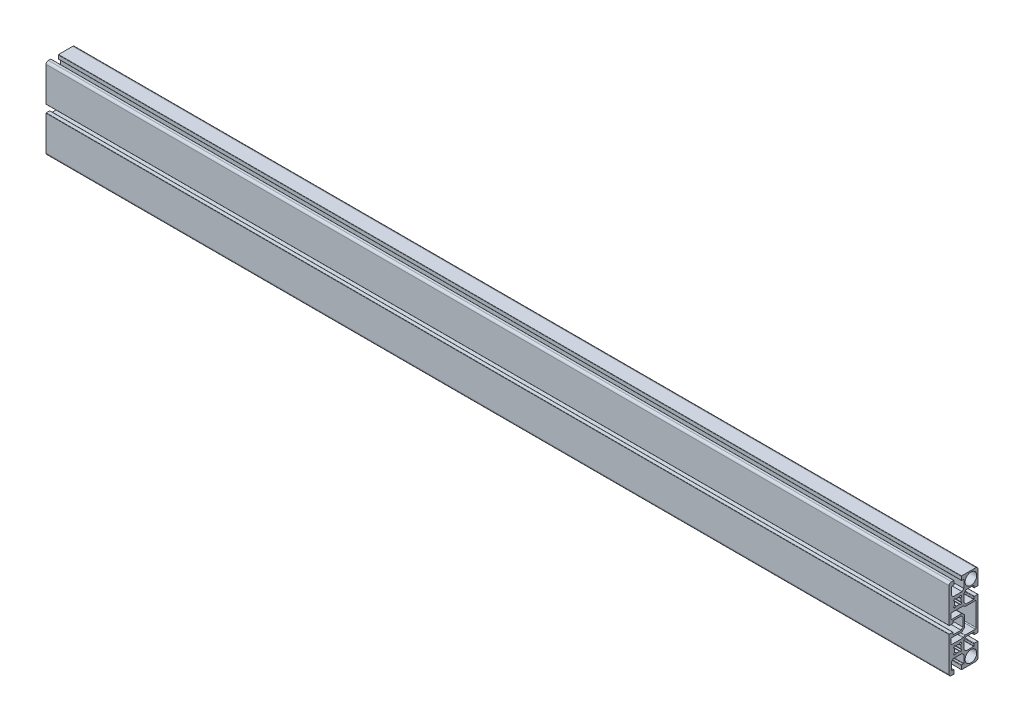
from build123d import *

# Parameters (mm, degrees)
MODEL23_R                       = 6.450000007
MODEL23_R_2                     = 6.449998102
F_45_SARJA_1_0033_90X32_1_DEPTH = 1000


with BuildPart() as part:
    # Model23 → 45-sarja 1.0033 90X32_1 (new body)
    with BuildSketch(Plane.YZ):
        with BuildLine():
            Line((-40.99999978, -4.099999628), (-44.699999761, -4.099999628))
            ThreePointArc((-44.699999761, -4.099999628), (-44.912131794, -4.187867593), (-44.999999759, -4.399999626))
            Line((-44.999999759, -4.399999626), (-44.999999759, -19.999999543))
            ThreePointArc((-44.999999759, -19.999999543), (-44.267766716, -21.767766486), (-42.499999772, -22.499999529))
            Line((-42.499999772, -22.499999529), (-26.899999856, -22.499999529))
            ThreePointArc((-26.899999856, -22.499999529), (-26.687867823, -22.412131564), (-26.599999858, -22.199999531))
            Line((-26.599999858, -22.199999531), (-26.599999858, -18.499999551))
            ThreePointArc((-26.599999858, -18.499999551), (-26.746446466, -18.146446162), (-27.099999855, -17.999999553))
            Line((-27.099999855, -17.999999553), (-28.999999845, -17.999999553))
            ThreePointArc((-28.999999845, -17.999999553), (-29.212131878, -17.912131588), (-29.299999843, -17.699999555))
            Line((-29.299999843, -17.699999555), (-29.299999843, -9.1999996))
            Line((-29.299999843, -9.1999996), (-27.299998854, -7.199999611))
            Line((-27.299998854, -7.199999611), (-17.700000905, -7.199999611))
            Line((-17.700000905, -7.199999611), (-15.700000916, -9.1999996))
            Line((-15.700000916, -9.1999996), (-15.700000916, -17.699999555))
            ThreePointArc((-15.700000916, -17.699999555), (-15.787868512, -17.912131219), (-15.99999987, -17.999999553))
            Line((-15.99999987, -17.999999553), (-17.89999986, -17.999999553))
            ThreePointArc((-17.89999986, -17.999999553), (-18.253553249, -18.146446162), (-18.399999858, -18.499999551))
            Line((-18.399999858, -18.499999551), (-18.399999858, -22.199999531))
            ThreePointArc((-18.399999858, -22.199999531), (-18.312132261, -22.412131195), (-18.100000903, -22.499999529))
            Line((-18.100000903, -22.499999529), (18.099996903, -22.499999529))
            ThreePointArc((18.099996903, -22.499999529), (18.312130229, -22.412132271), (18.399998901, -22.199999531))
            Line((18.399998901, -22.199999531), (18.399998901, -18.499999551))
            ThreePointArc((18.399998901, -18.499999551), (18.253552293, -18.146446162), (17.899998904, -17.999999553))
            Line((17.899998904, -17.999999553), (15.999998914, -17.999999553))
            ThreePointArc((15.999998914, -17.999999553), (15.787866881, -17.912131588), (15.699998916, -17.699999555))
            Line((15.699998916, -17.699999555), (15.699998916, -9.1999996))
            Line((15.699998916, -9.1999996), (17.699998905, -7.199999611))
            Line((17.699998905, -7.199999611), (27.300000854, -7.199999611))
            Line((27.300000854, -7.199999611), (29.300000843, -9.1999996))
            Line((29.300000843, -9.1999996), (29.300000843, -17.699999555))
            ThreePointArc((29.300000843, -17.699999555), (29.212132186, -17.91213228), (28.999998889, -17.999999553))
            Line((28.999998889, -17.999999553), (27.099996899, -17.999999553))
            ThreePointArc((27.099996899, -17.999999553), (26.746444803, -18.146446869), (26.599998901, -18.499999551))
            Line((26.599998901, -18.499999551), (26.599998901, -22.199999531))
            ThreePointArc((26.599998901, -22.199999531), (26.687867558, -22.412132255), (26.900000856, -22.499999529))
            Line((26.900000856, -22.499999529), (42.500000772, -22.499999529))
            ThreePointArc((42.500000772, -22.499999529), (44.267767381, -21.767766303), (45.000000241, -19.999999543))
            Line((45.000000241, -19.999999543), (45.000000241, -4.399999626))
            ThreePointArc((45.000000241, -4.399999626), (44.912132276, -4.187867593), (44.700000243, -4.099999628))
            Line((44.700000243, -4.099999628), (41.000000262, -4.099999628))
            ThreePointArc((41.000000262, -4.099999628), (40.646446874, -4.246446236), (40.500000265, -4.599999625))
            Line((40.500000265, -4.599999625), (40.500000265, -6.499999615))
            ThreePointArc((40.500000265, -6.499999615), (40.4121323, -6.712131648), (40.200000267, -6.799999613))
            Line((40.200000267, -6.799999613), (31.699997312, -6.799999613))
            Line((31.699997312, -6.799999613), (29.699997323, -4.799998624))
            Line((29.699997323, -4.799998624), (29.699997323, 4.799999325))
            Line((29.699997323, 4.799999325), (31.699997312, 6.799999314))
            Line((31.699997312, 6.799999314), (40.200000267, 6.799999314))
            ThreePointArc((40.200000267, 6.799999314), (40.4121323, 6.712131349), (40.500000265, 6.499999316))
            Line((40.500000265, 6.499999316), (40.500000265, 4.599999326))
            ThreePointArc((40.500000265, 4.599999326), (40.646447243, 4.246446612), (41.000000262, 4.100000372))
            Line((41.000000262, 4.100000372), (44.699997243, 4.100000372))
            ThreePointArc((44.699997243, 4.100000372), (44.912130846, 4.187866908), (45.000000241, 4.399999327))
            Line((45.000000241, 4.399999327), (45.000000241, 7.00000173))
            ThreePointArc((45.000000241, 7.00000173), (44.26776644, 8.767768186), (42.499999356, 9.500000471))
            Line((42.499999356, 9.500000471), (4.399999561, 9.500000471))
            ThreePointArc((4.399999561, 9.500000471), (4.187867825, 9.412132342), (4.100000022, 9.200000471))
            Line((4.100000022, 9.200000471), (4.100000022, 5.5000011))
            ThreePointArc((4.100000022, 5.5000011), (4.246446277, 5.146447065), (4.600000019, 5.000000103))
            Line((4.600000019, 5.000000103), (6.500018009, 5.000000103))
            ThreePointArc((6.500018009, 5.000000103), (6.71214889, 4.912132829), (6.800017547, 4.700002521))
            Line((6.800017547, 4.700002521), (6.800017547, -3.799986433))
            Line((6.800017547, -3.799986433), (4.800017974, -5.799986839))
            Line((4.800017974, -5.799986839), (-4.799987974, -5.799986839))
            Line((-4.799987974, -5.799986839), (-6.799987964, -3.79998685))
            Line((-6.799987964, -3.79998685), (-6.799987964, 4.700000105))
            ThreePointArc((-6.799987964, 4.700000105), (-6.712119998, 4.912132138), (-6.499987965, 5.000000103))
            Line((-6.499987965, 5.000000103), (-4.599997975, 5.000000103))
            ThreePointArc((-4.599997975, 5.000000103), (-4.24644588, 5.146447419), (-4.099999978, 5.5000001))
            Line((-4.099999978, 5.5000001), (-4.099999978, 9.200000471))
            ThreePointArc((-4.099999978, 9.200000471), (-4.187867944, 9.412132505), (-4.399999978, 9.500000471))
            Line((-4.399999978, 9.500000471), (-42.499999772, 9.500000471))
            ThreePointArc((-42.499999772, 9.500000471), (-44.26776713, 8.767767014), (-44.999999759, 6.999999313))
            Line((-44.999999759, 6.999999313), (-44.999999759, 4.399999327))
            ThreePointArc((-44.999999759, 4.399999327), (-44.912131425, 4.187867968), (-44.699999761, 4.100000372))
            Line((-44.699999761, 4.100000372), (-40.99999978, 4.100000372))
            ThreePointArc((-40.99999978, 4.100000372), (-40.646446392, 4.246446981), (-40.499999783, 4.60000037))
            Line((-40.499999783, 4.60000037), (-40.499999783, 6.500000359))
            ThreePointArc((-40.499999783, 6.500000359), (-40.412131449, 6.712131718), (-40.199999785, 6.799999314))
            Line((-40.199999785, 6.799999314), (-31.69999983, 6.799999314))
            Line((-31.69999983, 6.799999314), (-29.699999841, 4.799999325))
            Line((-29.699999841, 4.799999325), (-29.699999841, -4.799998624))
            Line((-29.699999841, -4.799998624), (-31.69999983, -6.799999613))
            Line((-31.69999983, -6.799999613), (-40.199999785, -6.799999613))
            ThreePointArc((-40.199999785, -6.799999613), (-40.412131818, -6.712131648), (-40.499999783, -6.499999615))
            Line((-40.499999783, -6.499999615), (-40.499999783, -4.599999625))
            ThreePointArc((-40.499999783, -4.599999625), (-40.646446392, -4.246446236), (-40.99999978, -4.099999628))
        make_face()
        with Locations((-37.149999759, -14.649999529)):
            Circle(MODEL23_R, mode=Mode.SUBTRACT)
        with Locations((37.150000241, -14.649999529)):
            Circle(MODEL23_R_2, mode=Mode.SUBTRACT)
        with BuildLine():
            Line((-12.700042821, -20.500004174), (12.699981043, -20.500004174))
            ThreePointArc((12.699981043, -20.500004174), (13.407087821, -20.207110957), (13.699981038, -19.500004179))
            Line((13.699981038, -19.500004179), (13.699981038, -8.507166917))
            ThreePointArc((13.699981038, -8.507166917), (13.776118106, -8.12444335), (13.992935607, -7.799998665))
            Line((13.992935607, -7.799998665), (15.007130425, -6.785799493))
            ThreePointArc((15.007130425, -6.785799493), (15.223902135, -6.461376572), (15.300022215, -6.078694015))
            Line((15.300022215, -6.078694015), (15.300022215, 6.499995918))
            ThreePointArc((15.300022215, 6.499995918), (15.007129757, 7.207104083), (14.30002222, 7.499998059))
            Line((14.30002222, 7.499998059), (9.799989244, 7.499998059))
            ThreePointArc((9.799989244, 7.499998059), (9.092882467, 7.207104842), (8.79998925, 6.499998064))
            Line((8.79998925, 6.499998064), (8.79998925, -4.492901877))
            ThreePointArc((8.79998925, -4.492901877), (8.723868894, -4.875585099), (8.507096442, -5.200008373))
            Line((8.507096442, -5.200008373), (6.199994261, -7.507112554))
            ThreePointArc((6.199994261, -7.507112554), (5.875571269, -7.723885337), (5.492888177, -7.800006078))
            Line((5.492888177, -7.800006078), (-5.492882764, -7.800006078))
            ThreePointArc((-5.492882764, -7.800006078), (-5.87556664, -7.723885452), (-6.199990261, -7.50711227))
            Line((-6.199990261, -7.50711227), (-8.507092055, -5.200008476))
            ThreePointArc((-8.507092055, -5.200008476), (-8.72386439, -4.875585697), (-8.799984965, -4.492903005))
            Line((-8.799984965, -4.492903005), (-8.799984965, 6.499997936))
            ThreePointArc((-8.799984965, 6.499997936), (-9.092878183, 7.207104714), (-9.79998496, 7.499997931))
            Line((-9.79998496, 7.499997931), (-14.300017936, 7.499997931))
            ThreePointArc((-14.300017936, 7.499997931), (-15.007125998, 7.207105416), (-15.300019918, 6.499997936))
            Line((-15.300019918, 6.499997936), (-15.300019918, -6.078691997))
            ThreePointArc((-15.300019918, -6.078691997), (-15.22390002, -6.461374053), (-15.007128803, -6.785796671))
            Line((-15.007128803, -6.785796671), (-13.99293393, -7.799997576))
            ThreePointArc((-13.99293393, -7.799997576), (-13.776162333, -8.124421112), (-13.700042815, -8.507104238))
            Line((-13.700042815, -8.507104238), (-13.700042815, -19.50000418))
            ThreePointArc((-13.700042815, -19.50000418), (-13.407149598, -20.207110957), (-12.700042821, -20.500004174))
        make_face(mode=Mode.SUBTRACT)
        with BuildLine():
            Line((-25.89411253, 4.384062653), (-26.884061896, 3.394112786))
            ThreePointArc((-26.884061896, 3.394112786), (-26.971929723, 3.181981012), (-26.884061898, 2.969849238))
            Line((-26.884061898, 2.969849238), (-25.863290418, 1.94907723))
            ThreePointArc((-25.863290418, 1.94907723), (-25.779575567, 1.786690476), (-25.805579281, 1.605855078))
            ThreePointArc((-25.805579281, 1.605855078), (-26.174999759, 4.22e-07), (-25.805579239, -1.605854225))
            ThreePointArc((-25.805579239, -1.605854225), (-25.779575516, -1.786689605), (-25.863290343, -1.949076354))
            Line((-25.863290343, -1.949076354), (-26.884061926, -2.969848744))
            ThreePointArc((-26.884061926, -2.969848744), (-26.971929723, -3.181980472), (-26.88406195, -3.39411221))
            Line((-26.88406195, -3.39411221), (-25.894113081, -4.384062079))
            ThreePointArc((-25.894113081, -4.384062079), (-25.681980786, -4.471930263), (-25.469848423, -4.384062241))
            Line((-25.469848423, -4.384062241), (-24.449076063, -3.36329041))
            ThreePointArc((-24.449076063, -3.36329041), (-24.286689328, -3.279575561), (-24.105853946, -3.305579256))
            ThreePointArc((-24.105853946, -3.305579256), (-22.499999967, -3.674999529), (-20.894145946, -3.305579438))
            ThreePointArc((-20.894145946, -3.305579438), (-20.713310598, -3.279575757), (-20.550923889, -3.363290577))
            Line((-20.550923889, -3.363290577), (-19.53015139, -4.38406227))
            ThreePointArc((-19.53015139, -4.38406227), (-19.318019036, -4.471930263), (-19.105886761, -4.384062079))
            Line((-19.105886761, -4.384062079), (-18.11593789, -3.394112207))
            ThreePointArc((-18.11593789, -3.394112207), (-18.028070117, -3.181980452), (-18.115937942, -2.969848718))
            Line((-18.115937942, -2.969848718), (-19.136709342, -1.949076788))
            ThreePointArc((-19.136709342, -1.949076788), (-19.220424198, -1.786690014), (-19.194420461, -1.605854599))
            ThreePointArc((-19.194420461, -1.605854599), (-18.824999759, 2.3e-07), (-19.19442025, 1.605855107))
            ThreePointArc((-19.19442025, 1.605855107), (-19.22042397, 1.786690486), (-19.136709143, 1.949077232))
            Line((-19.136709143, 1.949077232), (-18.115937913, 2.969849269))
            ThreePointArc((-18.115937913, 2.969849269), (-18.028070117, 3.181980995), (-18.11593789, 3.39411273))
            Line((-18.11593789, 3.39411273), (-19.105886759, 4.384062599))
            ThreePointArc((-19.105886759, 4.384062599), (-19.318019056, 4.471930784), (-19.530151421, 4.384062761))
            Line((-19.530151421, 4.384062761), (-20.550923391, 3.36329132))
            ThreePointArc((-20.550923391, 3.36329132), (-20.713310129, 3.279576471), (-20.894145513, 3.305580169))
            ThreePointArc((-20.894145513, 3.305580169), (-22.499999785, 3.675000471), (-24.105854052, 3.305580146))
            ThreePointArc((-24.105854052, 3.305580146), (-24.286689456, 3.279576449), (-24.449076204, 3.363291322))
            Line((-24.449076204, 3.363291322), (-25.469847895, 4.384062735))
            ThreePointArc((-25.469847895, 4.384062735), (-25.681980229, 4.471930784), (-25.89411253, 4.384062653))
        make_face(mode=Mode.SUBTRACT)
        with BuildLine():
            Line((19.10588747, 4.384062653), (18.115938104, 3.394112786))
            ThreePointArc((18.115938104, 3.394112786), (18.028070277, 3.181981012), (18.115938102, 2.969849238))
            Line((18.115938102, 2.969849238), (19.136709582, 1.94907723))
            ThreePointArc((19.136709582, 1.94907723), (19.220424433, 1.786690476), (19.194420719, 1.605855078))
            ThreePointArc((19.194420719, 1.605855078), (18.825000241, 4.22e-07), (19.194420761, -1.605854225))
            ThreePointArc((19.194420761, -1.605854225), (19.220424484, -1.786689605), (19.136709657, -1.949076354))
            Line((19.136709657, -1.949076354), (18.115938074, -2.969848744))
            ThreePointArc((18.115938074, -2.969848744), (18.028070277, -3.181980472), (18.11593805, -3.39411221))
            Line((18.11593805, -3.39411221), (19.105886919, -4.384062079))
            ThreePointArc((19.105886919, -4.384062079), (19.318019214, -4.471930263), (19.530151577, -4.384062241))
            Line((19.530151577, -4.384062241), (20.550923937, -3.36329041))
            ThreePointArc((20.550923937, -3.36329041), (20.713310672, -3.279575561), (20.894146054, -3.305579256))
            ThreePointArc((20.894146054, -3.305579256), (22.500000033, -3.674999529), (24.105854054, -3.305579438))
            ThreePointArc((24.105854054, -3.305579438), (24.286689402, -3.279575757), (24.449076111, -3.363290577))
            Line((24.449076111, -3.363290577), (25.46984861, -4.38406227))
            ThreePointArc((25.46984861, -4.38406227), (25.681980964, -4.471930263), (25.894113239, -4.384062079))
            Line((25.894113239, -4.384062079), (26.88406211, -3.394112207))
            ThreePointArc((26.88406211, -3.394112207), (26.971929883, -3.181980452), (26.884062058, -2.969848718))
            Line((26.884062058, -2.969848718), (25.863290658, -1.949076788))
            ThreePointArc((25.863290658, -1.949076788), (25.779575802, -1.786690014), (25.805579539, -1.605854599))
            ThreePointArc((25.805579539, -1.605854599), (26.175000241, 2.3e-07), (25.805579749, 1.605855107))
            ThreePointArc((25.805579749, 1.605855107), (25.77957603, 1.786690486), (25.863290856, 1.949077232))
            Line((25.863290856, 1.949077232), (26.884062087, 2.969849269))
            ThreePointArc((26.884062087, 2.969849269), (26.971929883, 3.181980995), (26.88406211, 3.39411273))
            Line((26.88406211, 3.39411273), (25.894113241, 4.384062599))
            ThreePointArc((25.894113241, 4.384062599), (25.681980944, 4.471930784), (25.469848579, 4.384062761))
            Line((25.469848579, 4.384062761), (24.449076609, 3.36329132))
            ThreePointArc((24.449076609, 3.36329132), (24.286689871, 3.279576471), (24.105854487, 3.305580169))
            ThreePointArc((24.105854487, 3.305580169), (22.500000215, 3.675000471), (20.894145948, 3.305580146))
            ThreePointArc((20.894145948, 3.305580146), (20.713310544, 3.279576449), (20.550923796, 3.363291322))
            Line((20.550923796, 3.363291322), (19.530152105, 4.384062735))
            ThreePointArc((19.530152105, 4.384062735), (19.318019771, 4.471930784), (19.10588747, 4.384062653))
        make_face(mode=Mode.SUBTRACT)
    extrude(amount=F_45_SARJA_1_0033_90X32_1_DEPTH)


solid = part.part
